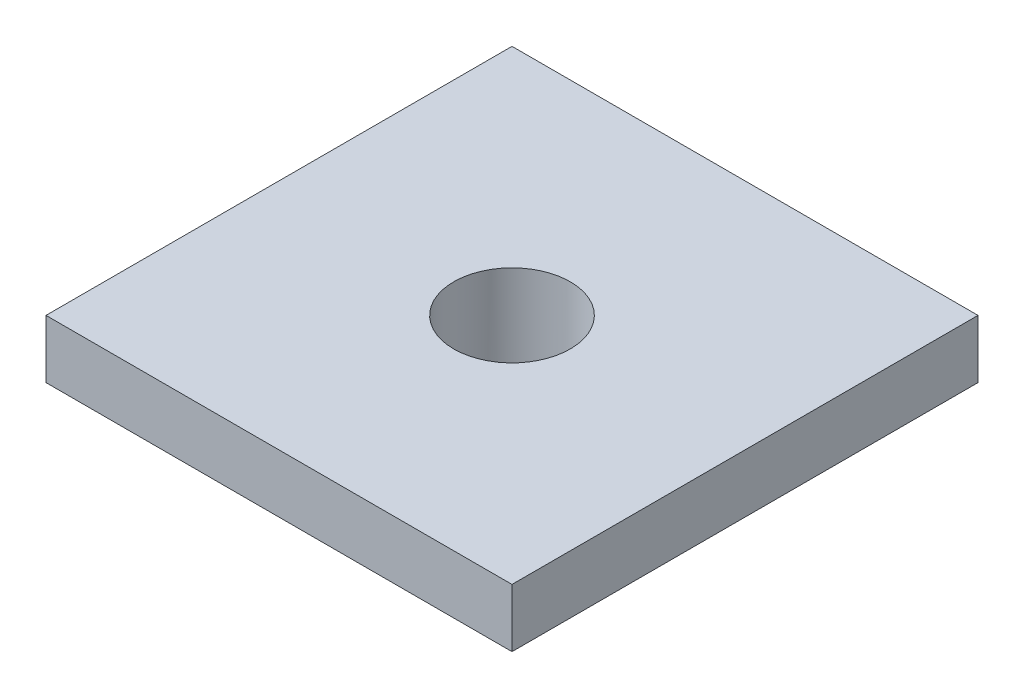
ISO-10303-21;
HEADER;
FILE_DESCRIPTION(('STEP AP214'),'2;1');
FILE_NAME('part.step','',(''),(''),'','','');
FILE_SCHEMA(('AUTOMOTIVE_DESIGN { 1 0 10303 214 1 1 1 1 }'));
ENDSEC;
DATA;
#1=APPLICATION_CONTEXT('core data for automotive mechanical design processes');
#2=APPLICATION_PROTOCOL_DEFINITION('international standard','automotive_design',2000,#1);
#3=PRODUCT_CONTEXT('',#1,'mechanical');
#4=PRODUCT('Part','Part','',(#3));
#5=PRODUCT_RELATED_PRODUCT_CATEGORY('part','',(#4));
#6=PRODUCT_DEFINITION_FORMATION('','',#4);
#7=PRODUCT_DEFINITION_CONTEXT('part definition',#1,'design');
#8=PRODUCT_DEFINITION('design','',#6,#7);
#9=PRODUCT_DEFINITION_SHAPE('','',#8);
#10=(LENGTH_UNIT() NAMED_UNIT(*) SI_UNIT(.MILLI.,.METRE.));
#11=(NAMED_UNIT(*) PLANE_ANGLE_UNIT() SI_UNIT($,.RADIAN.));
#12=(NAMED_UNIT(*) SI_UNIT($,.STERADIAN.) SOLID_ANGLE_UNIT());
#13=UNCERTAINTY_MEASURE_WITH_UNIT(LENGTH_MEASURE(1.E-05),#10,'distance_accuracy_value','');
#14=(GEOMETRIC_REPRESENTATION_CONTEXT(3) GLOBAL_UNCERTAINTY_ASSIGNED_CONTEXT((#13)) GLOBAL_UNIT_ASSIGNED_CONTEXT((#10,
#11,#12)) REPRESENTATION_CONTEXT('',''));
#15=CARTESIAN_POINT('',(0.,0.,0.));
#16=DIRECTION('',(0.,0.,1.));
#17=DIRECTION('',(1.,0.,0.));
#18=AXIS2_PLACEMENT_3D('',#15,#16,#17);
#19=CARTESIAN_POINT('',(0.,-10.,0.));
#20=DIRECTION('',(-1.,0.,0.));
#21=DIRECTION('',(0.,0.,1.));
#22=AXIS2_PLACEMENT_3D('',#19,#20,#21);
#23=PLANE('',#22);
#24=DIRECTION('',(0.,0.,1.));
#25=VECTOR('',#24,1.);
#26=CARTESIAN_POINT('',(0.,0.,0.));
#27=LINE('',#26,#25);
#28=CARTESIAN_POINT('',(0.,0.,-80.));
#29=VERTEX_POINT('',#28);
#30=CARTESIAN_POINT('',(0.,0.,0.));
#31=VERTEX_POINT('',#30);
#32=EDGE_CURVE('E145',#29,#31,#27,.T.);
#33=ORIENTED_EDGE('',*,*,#32,.F.);
#34=DIRECTION('',(0.,1.,0.));
#35=VECTOR('',#34,1.);
#36=CARTESIAN_POINT('',(0.,-10.,-80.));
#37=LINE('',#36,#35);
#38=CARTESIAN_POINT('',(0.,-10.,-80.));
#39=VERTEX_POINT('',#38);
#40=EDGE_CURVE('E11',#39,#29,#37,.T.);
#41=ORIENTED_EDGE('',*,*,#40,.F.);
#42=DIRECTION('',(0.,0.,1.));
#43=VECTOR('',#42,1.);
#44=CARTESIAN_POINT('',(0.,-10.,0.));
#45=LINE('',#44,#43);
#46=CARTESIAN_POINT('',(0.,-10.,0.));
#47=VERTEX_POINT('',#46);
#48=EDGE_CURVE('E144',#39,#47,#45,.T.);
#49=ORIENTED_EDGE('',*,*,#48,.T.);
#50=DIRECTION('',(0.,1.,0.));
#51=VECTOR('',#50,1.);
#52=CARTESIAN_POINT('',(0.,-10.,0.));
#53=LINE('',#52,#51);
#54=EDGE_CURVE('E158',#47,#31,#53,.T.);
#55=ORIENTED_EDGE('',*,*,#54,.T.);
#56=EDGE_LOOP('',(#33,#41,#49,#55));
#57=FACE_BOUND('',#56,.T.);
#58=ADVANCED_FACE('F39',(#57),#23,.T.);
#59=CARTESIAN_POINT('',(0.,-10.,-80.));
#60=DIRECTION('',(0.,0.,-1.));
#61=DIRECTION('',(-1.,0.,0.));
#62=AXIS2_PLACEMENT_3D('',#59,#60,#61);
#63=PLANE('',#62);
#64=DIRECTION('',(-1.,0.,0.));
#65=VECTOR('',#64,1.);
#66=CARTESIAN_POINT('',(0.,0.,-80.));
#67=LINE('',#66,#65);
#68=CARTESIAN_POINT('',(80.,0.,-80.));
#69=VERTEX_POINT('',#68);
#70=EDGE_CURVE('E149',#69,#29,#67,.T.);
#71=ORIENTED_EDGE('',*,*,#70,.F.);
#72=DIRECTION('',(0.,1.,0.));
#73=VECTOR('',#72,1.);
#74=CARTESIAN_POINT('',(80.,-10.,-80.));
#75=LINE('',#74,#73);
#76=CARTESIAN_POINT('',(80.,-10.,-80.));
#77=VERTEX_POINT('',#76);
#78=EDGE_CURVE('E50',#77,#69,#75,.T.);
#79=ORIENTED_EDGE('',*,*,#78,.F.);
#80=DIRECTION('',(-1.,0.,0.));
#81=VECTOR('',#80,1.);
#82=CARTESIAN_POINT('',(0.,-10.,-80.));
#83=LINE('',#82,#81);
#84=EDGE_CURVE('E154',#77,#39,#83,.T.);
#85=ORIENTED_EDGE('',*,*,#84,.T.);
#86=ORIENTED_EDGE('',*,*,#40,.T.);
#87=EDGE_LOOP('',(#71,#79,#85,#86));
#88=FACE_BOUND('',#87,.T.);
#89=ADVANCED_FACE('F181',(#88),#63,.T.);
#90=CARTESIAN_POINT('',(80.,-10.,0.));
#91=DIRECTION('',(1.,0.,0.));
#92=DIRECTION('',(0.,0.,-1.));
#93=AXIS2_PLACEMENT_3D('',#90,#91,#92);
#94=PLANE('',#93);
#95=DIRECTION('',(0.,0.,-1.));
#96=VECTOR('',#95,1.);
#97=CARTESIAN_POINT('',(80.,0.,0.));
#98=LINE('',#97,#96);
#99=CARTESIAN_POINT('',(80.,0.,0.));
#100=VERTEX_POINT('',#99);
#101=EDGE_CURVE('E163',#100,#69,#98,.T.);
#102=ORIENTED_EDGE('',*,*,#101,.F.);
#103=DIRECTION('',(0.,1.,0.));
#104=VECTOR('',#103,1.);
#105=CARTESIAN_POINT('',(80.,-10.,0.));
#106=LINE('',#105,#104);
#107=CARTESIAN_POINT('',(80.,-10.,0.));
#108=VERTEX_POINT('',#107);
#109=EDGE_CURVE('E168',#108,#100,#106,.T.);
#110=ORIENTED_EDGE('',*,*,#109,.F.);
#111=DIRECTION('',(0.,0.,-1.));
#112=VECTOR('',#111,1.);
#113=CARTESIAN_POINT('',(80.,-10.,0.));
#114=LINE('',#113,#112);
#115=EDGE_CURVE('E155',#108,#77,#114,.T.);
#116=ORIENTED_EDGE('',*,*,#115,.T.);
#117=ORIENTED_EDGE('',*,*,#78,.T.);
#118=EDGE_LOOP('',(#102,#110,#116,#117));
#119=FACE_BOUND('',#118,.T.);
#120=ADVANCED_FACE('F190',(#119),#94,.T.);
#121=CARTESIAN_POINT('',(0.,-10.,0.));
#122=DIRECTION('',(0.,0.,1.));
#123=DIRECTION('',(1.,0.,0.));
#124=AXIS2_PLACEMENT_3D('',#121,#122,#123);
#125=PLANE('',#124);
#126=DIRECTION('',(1.,0.,0.));
#127=VECTOR('',#126,1.);
#128=CARTESIAN_POINT('',(0.,0.,0.));
#129=LINE('',#128,#127);
#130=EDGE_CURVE('E161',#31,#100,#129,.T.);
#131=ORIENTED_EDGE('',*,*,#130,.F.);
#132=ORIENTED_EDGE('',*,*,#54,.F.);
#133=DIRECTION('',(1.,0.,0.));
#134=VECTOR('',#133,1.);
#135=CARTESIAN_POINT('',(0.,-10.,0.));
#136=LINE('',#135,#134);
#137=EDGE_CURVE('E146',#47,#108,#136,.T.);
#138=ORIENTED_EDGE('',*,*,#137,.T.);
#139=ORIENTED_EDGE('',*,*,#109,.T.);
#140=EDGE_LOOP('',(#131,#132,#138,#139));
#141=FACE_BOUND('',#140,.T.);
#142=ADVANCED_FACE('F180',(#141),#125,.T.);
#143=CARTESIAN_POINT('',(0.,-10.,0.));
#144=DIRECTION('',(0.,-1.,0.));
#145=DIRECTION('',(0.,0.,-1.));
#146=AXIS2_PLACEMENT_3D('',#143,#144,#145);
#147=PLANE('',#146);
#148=DIRECTION('',(0.,0.,-1.));
#149=VECTOR('',#148,1.);
#150=CARTESIAN_POINT('',(15.,-10.,0.));
#151=LINE('',#150,#149);
#152=CARTESIAN_POINT('',(15.,-10.,-15.));
#153=VERTEX_POINT('',#152);
#154=CARTESIAN_POINT('',(15.,-10.,-65.));
#155=VERTEX_POINT('',#154);
#156=EDGE_CURVE('E142',#153,#155,#151,.T.);
#157=ORIENTED_EDGE('',*,*,#156,.F.);
#158=DIRECTION('',(-1.,0.,0.));
#159=VECTOR('',#158,1.);
#160=CARTESIAN_POINT('',(0.,-10.,-15.));
#161=LINE('',#160,#159);
#162=CARTESIAN_POINT('',(65.,-10.,-15.));
#163=VERTEX_POINT('',#162);
#164=EDGE_CURVE('E107',#163,#153,#161,.T.);
#165=ORIENTED_EDGE('',*,*,#164,.F.);
#166=DIRECTION('',(0.,0.,1.));
#167=VECTOR('',#166,1.);
#168=CARTESIAN_POINT('',(65.,-10.,0.));
#169=LINE('',#168,#167);
#170=CARTESIAN_POINT('',(65.,-10.,-65.));
#171=VERTEX_POINT('',#170);
#172=EDGE_CURVE('E58',#171,#163,#169,.T.);
#173=ORIENTED_EDGE('',*,*,#172,.F.);
#174=DIRECTION('',(1.,0.,0.));
#175=VECTOR('',#174,1.);
#176=CARTESIAN_POINT('',(0.,-10.,-65.));
#177=LINE('',#176,#175);
#178=EDGE_CURVE('E54',#155,#171,#177,.T.);
#179=ORIENTED_EDGE('',*,*,#178,.F.);
#180=EDGE_LOOP('',(#157,#165,#173,#179));
#181=FACE_BOUND('',#180,.T.);
#182=ORIENTED_EDGE('',*,*,#48,.F.);
#183=ORIENTED_EDGE('',*,*,#84,.F.);
#184=ORIENTED_EDGE('',*,*,#115,.F.);
#185=ORIENTED_EDGE('',*,*,#137,.F.);
#186=EDGE_LOOP('',(#182,#183,#184,#185));
#187=FACE_BOUND('',#186,.T.);
#188=ADVANCED_FACE('F188',(#181,#187),#147,.T.);
#189=CARTESIAN_POINT('',(0.,0.,0.));
#190=DIRECTION('',(0.,-1.,0.));
#191=DIRECTION('',(0.,0.,-1.));
#192=AXIS2_PLACEMENT_3D('',#189,#190,#191);
#193=PLANE('',#192);
#194=CARTESIAN_POINT('',(40.,0.,-40.));
#195=DIRECTION('',(0.,1.,0.));
#196=DIRECTION('',(0.,0.,1.));
#197=AXIS2_PLACEMENT_3D('',#194,#195,#196);
#198=CIRCLE('',#197,10.);
#199=CARTESIAN_POINT('',(40.,0.,-30.));
#200=VERTEX_POINT('',#199);
#201=EDGE_CURVE('E129',#200,#200,#198,.T.);
#202=ORIENTED_EDGE('',*,*,#201,.F.);
#203=EDGE_LOOP('',(#202));
#204=FACE_BOUND('',#203,.T.);
#205=ORIENTED_EDGE('',*,*,#32,.T.);
#206=ORIENTED_EDGE('',*,*,#130,.T.);
#207=ORIENTED_EDGE('',*,*,#101,.T.);
#208=ORIENTED_EDGE('',*,*,#70,.T.);
#209=EDGE_LOOP('',(#205,#206,#207,#208));
#210=FACE_BOUND('',#209,.T.);
#211=ADVANCED_FACE('F179',(#204,#210),#193,.F.);
#212=CARTESIAN_POINT('',(15.,-15.,-15.));
#213=DIRECTION('',(-1.,0.,0.));
#214=DIRECTION('',(0.,0.,1.));
#215=AXIS2_PLACEMENT_3D('',#212,#213,#214);
#216=PLANE('',#215);
#217=DIRECTION('',(0.,1.,0.));
#218=VECTOR('',#217,1.);
#219=CARTESIAN_POINT('',(15.,-15.,-15.));
#220=LINE('',#219,#218);
#221=CARTESIAN_POINT('',(15.,-15.,-15.));
#222=VERTEX_POINT('',#221);
#223=EDGE_CURVE('E103',#222,#153,#220,.T.);
#224=ORIENTED_EDGE('',*,*,#223,.T.);
#225=ORIENTED_EDGE('',*,*,#156,.T.);
#226=DIRECTION('',(0.,1.,0.));
#227=VECTOR('',#226,1.);
#228=CARTESIAN_POINT('',(15.,-15.,-65.));
#229=LINE('',#228,#227);
#230=CARTESIAN_POINT('',(15.,-15.,-65.));
#231=VERTEX_POINT('',#230);
#232=EDGE_CURVE('E127',#231,#155,#229,.T.);
#233=ORIENTED_EDGE('',*,*,#232,.F.);
#234=DIRECTION('',(0.,0.,1.));
#235=VECTOR('',#234,1.);
#236=CARTESIAN_POINT('',(15.,-15.,-15.));
#237=LINE('',#236,#235);
#238=EDGE_CURVE('E120',#231,#222,#237,.T.);
#239=ORIENTED_EDGE('',*,*,#238,.T.);
#240=EDGE_LOOP('',(#224,#225,#233,#239));
#241=FACE_BOUND('',#240,.T.);
#242=ADVANCED_FACE('F123',(#241),#216,.T.);
#243=CARTESIAN_POINT('',(15.,-15.,-65.));
#244=DIRECTION('',(0.,0.,-1.));
#245=DIRECTION('',(-1.,0.,0.));
#246=AXIS2_PLACEMENT_3D('',#243,#244,#245);
#247=PLANE('',#246);
#248=ORIENTED_EDGE('',*,*,#232,.T.);
#249=ORIENTED_EDGE('',*,*,#178,.T.);
#250=DIRECTION('',(0.,1.,0.));
#251=VECTOR('',#250,1.);
#252=CARTESIAN_POINT('',(65.,-15.,-65.));
#253=LINE('',#252,#251);
#254=CARTESIAN_POINT('',(65.,-15.,-65.));
#255=VERTEX_POINT('',#254);
#256=EDGE_CURVE('E131',#255,#171,#253,.T.);
#257=ORIENTED_EDGE('',*,*,#256,.F.);
#258=DIRECTION('',(-1.,0.,0.));
#259=VECTOR('',#258,1.);
#260=CARTESIAN_POINT('',(15.,-15.,-65.));
#261=LINE('',#260,#259);
#262=EDGE_CURVE('E115',#255,#231,#261,.T.);
#263=ORIENTED_EDGE('',*,*,#262,.T.);
#264=EDGE_LOOP('',(#248,#249,#257,#263));
#265=FACE_BOUND('',#264,.T.);
#266=ADVANCED_FACE('F245',(#265),#247,.T.);
#267=CARTESIAN_POINT('',(65.,-15.,-15.));
#268=DIRECTION('',(1.,0.,0.));
#269=DIRECTION('',(0.,0.,-1.));
#270=AXIS2_PLACEMENT_3D('',#267,#268,#269);
#271=PLANE('',#270);
#272=ORIENTED_EDGE('',*,*,#256,.T.);
#273=ORIENTED_EDGE('',*,*,#172,.T.);
#274=DIRECTION('',(0.,1.,0.));
#275=VECTOR('',#274,1.);
#276=CARTESIAN_POINT('',(65.,-15.,-15.));
#277=LINE('',#276,#275);
#278=CARTESIAN_POINT('',(65.,-15.,-15.));
#279=VERTEX_POINT('',#278);
#280=EDGE_CURVE('E112',#279,#163,#277,.T.);
#281=ORIENTED_EDGE('',*,*,#280,.F.);
#282=DIRECTION('',(0.,0.,-1.));
#283=VECTOR('',#282,1.);
#284=CARTESIAN_POINT('',(65.,-15.,-15.));
#285=LINE('',#284,#283);
#286=EDGE_CURVE('E125',#279,#255,#285,.T.);
#287=ORIENTED_EDGE('',*,*,#286,.T.);
#288=EDGE_LOOP('',(#272,#273,#281,#287));
#289=FACE_BOUND('',#288,.T.);
#290=ADVANCED_FACE('F251',(#289),#271,.T.);
#291=CARTESIAN_POINT('',(15.,-15.,-15.));
#292=DIRECTION('',(0.,0.,1.));
#293=DIRECTION('',(1.,0.,0.));
#294=AXIS2_PLACEMENT_3D('',#291,#292,#293);
#295=PLANE('',#294);
#296=ORIENTED_EDGE('',*,*,#280,.T.);
#297=ORIENTED_EDGE('',*,*,#164,.T.);
#298=ORIENTED_EDGE('',*,*,#223,.F.);
#299=DIRECTION('',(1.,0.,0.));
#300=VECTOR('',#299,1.);
#301=CARTESIAN_POINT('',(15.,-15.,-15.));
#302=LINE('',#301,#300);
#303=EDGE_CURVE('E110',#222,#279,#302,.T.);
#304=ORIENTED_EDGE('',*,*,#303,.T.);
#305=EDGE_LOOP('',(#296,#297,#298,#304));
#306=FACE_BOUND('',#305,.T.);
#307=ADVANCED_FACE('F106',(#306),#295,.T.);
#308=CARTESIAN_POINT('',(0.,-15.,0.));
#309=DIRECTION('',(0.,-1.,0.));
#310=DIRECTION('',(0.,0.,-1.));
#311=AXIS2_PLACEMENT_3D('',#308,#309,#310);
#312=PLANE('',#311);
#313=CARTESIAN_POINT('',(40.,-15.,-40.));
#314=DIRECTION('',(0.,-1.,0.));
#315=DIRECTION('',(0.,0.,-1.));
#316=AXIS2_PLACEMENT_3D('',#313,#314,#315);
#317=CIRCLE('',#316,10.);
#318=CARTESIAN_POINT('',(40.,-15.,-50.));
#319=VERTEX_POINT('',#318);
#320=EDGE_CURVE('E45',#319,#319,#317,.T.);
#321=ORIENTED_EDGE('',*,*,#320,.F.);
#322=EDGE_LOOP('',(#321));
#323=FACE_BOUND('',#322,.T.);
#324=ORIENTED_EDGE('',*,*,#238,.F.);
#325=ORIENTED_EDGE('',*,*,#262,.F.);
#326=ORIENTED_EDGE('',*,*,#286,.F.);
#327=ORIENTED_EDGE('',*,*,#303,.F.);
#328=EDGE_LOOP('',(#324,#325,#326,#327));
#329=FACE_BOUND('',#328,.T.);
#330=ADVANCED_FACE('F119',(#323,#329),#312,.T.);
#331=CARTESIAN_POINT('',(40.,-25.,-40.));
#332=DIRECTION('',(0.,1.,0.));
#333=DIRECTION('',(0.,0.,1.));
#334=AXIS2_PLACEMENT_3D('',#331,#332,#333);
#335=CYLINDRICAL_SURFACE('',#334,10.);
#336=ORIENTED_EDGE('',*,*,#320,.T.);
#337=EDGE_LOOP('',(#336));
#338=FACE_BOUND('',#337,.T.);
#339=ORIENTED_EDGE('',*,*,#201,.T.);
#340=EDGE_LOOP('',(#339));
#341=FACE_BOUND('',#340,.T.);
#342=ADVANCED_FACE('F279',(#338,#341),#335,.F.);
#343=CLOSED_SHELL('',(#58,#89,#120,#142,#188,#211,#242,#266,#290,#307,#330,#342));
#344=MANIFOLD_SOLID_BREP('B2',#343);
#345=ADVANCED_BREP_SHAPE_REPRESENTATION('',(#18,#344),#14);
#346=SHAPE_DEFINITION_REPRESENTATION(#9,#345);
ENDSEC;
END-ISO-10303-21;
